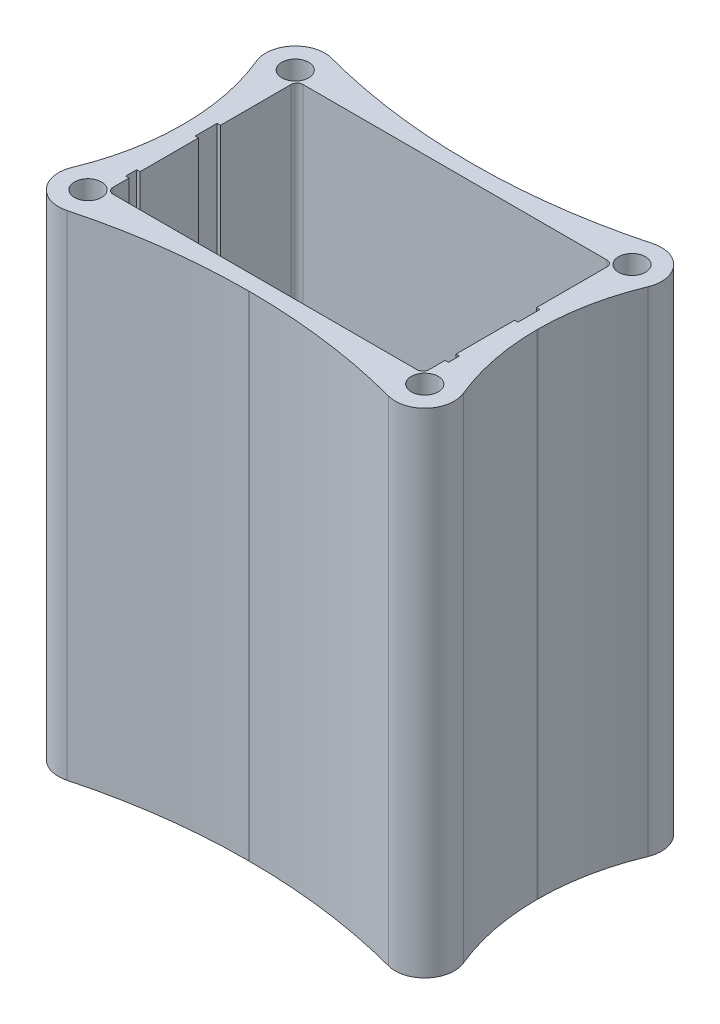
from build123d import *

# Parameters (mm, degrees)
SKETCH1_R           = 2.25
SKETCH1_W           = 13.58
SKETCH1_H           = 12.53
BOSS_EXTRUDE1_DEPTH = 7.25
SKETCH2_W           = 10
SKETCH2_H           = 12.53
CUT_EXTRUDE1_DEPTH  = 3.5
BOSS_EXTRUDE4_START = 75
SKETCH1_12_R        = 2.25
BOSS_EXTRUDE4_DEPTH = 75
FILLET1_R           = 40
FILLET2_R           = 103


with BuildPart() as part:
    # Sketch1 → Boss-Extrude1 (new body)
    with BuildSketch(Plane(origin=(0, 0, 0), x_dir=(1, 0, 0), z_dir=(0, 1, 0))):
        with BuildLine():
            Line((-29.56, 28.41642837), (-29.56, 3.25357163))
            ThreePointArc((-29.56, 3.25357163), (-31.446417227, -5.006638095), (-23.302108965, -2.67))
            Line((-23.302108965, -2.67), (23.302108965, -2.67))
            ThreePointArc((23.302108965, -2.67), (31.446417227, -5.006638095), (29.56, 3.25357163))
            Line((29.56, 3.25357163), (29.56, 28.41642837))
            ThreePointArc((29.56, 28.41642837), (31.446417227, 36.676638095), (23.302108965, 34.34))
            Line((23.302108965, 34.34), (-23.302108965, 34.34))
            ThreePointArc((-23.302108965, 34.34), (-31.446417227, 36.676638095), (-29.56, 28.41642837))
        make_face()
        with Locations(Location((-28.064205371, -1.433538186, 0), (0, 0, 270))):
            Circle(SKETCH1_R, mode=Mode.SUBTRACT)
        with Locations(Location((-28.064205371, 33.103538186, 0), (0, 0, 270))):
            Circle(SKETCH1_R, mode=Mode.SUBTRACT)
        with Locations(Location((28.064205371, 33.103538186, 0), (0, 0, 270))):
            Circle(SKETCH1_R, mode=Mode.SUBTRACT)
        with Locations(Location((28.064205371, -1.433538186, 0), (0, 0, 270))):
            Circle(SKETCH1_R, mode=Mode.SUBTRACT)
        with Locations((11.36, 10.85)):
            Rectangle(SKETCH1_W, SKETCH1_H, mode=Mode.SUBTRACT)
    extrude(amount=-BOSS_EXTRUDE1_DEPTH)

    # Sketch2 → Cut-Extrude1 (cut)
    with BuildSketch(Plane(origin=(0, 0, 0), x_dir=(1, 0, 0), z_dir=(0, 1, 0))):
        with Locations((-17.89, 10.85)):
            Rectangle(SKETCH2_W, SKETCH2_H)
    extrude(amount=-CUT_EXTRUDE1_DEPTH, mode=Mode.SUBTRACT)

    # Sketch1_12 → Boss-Extrude4 (add)
    with BuildSketch(Plane(origin=(0, 0, 0), x_dir=(1, 0, 0), z_dir=(0, 1, 0)).offset(BOSS_EXTRUDE4_START)):
        with BuildLine():
            Line((-29.56, 28.41642837), (-29.56, 3.25357163))
            ThreePointArc((-29.56, 3.25357163), (-31.446417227, -5.006638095), (-23.302108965, -2.67))
            Line((-23.302108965, -2.67), (23.302108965, -2.67))
            ThreePointArc((23.302108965, -2.67), (31.446417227, -5.006638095), (29.56, 3.25357163))
            Line((29.56, 3.25357163), (29.56, 28.41642837))
            ThreePointArc((29.56, 28.41642837), (31.446417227, 36.676638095), (23.302108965, 34.34))
            Line((23.302108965, 34.34), (-23.302108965, 34.34))
            ThreePointArc((-23.302108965, 34.34), (-31.446417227, 36.676638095), (-29.56, 28.41642837))
        make_face()
        with Locations(Location((-28.064205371, -1.433538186, 0), (0, 0, 270))):
            Circle(SKETCH1_12_R, mode=Mode.SUBTRACT)
        with Locations(Location((-28.064205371, 33.103538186, 0), (0, 0, 270))):
            Circle(SKETCH1_12_R, mode=Mode.SUBTRACT)
        with Locations(Location((28.064205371, 33.103538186, 0), (0, 0, 270))):
            Circle(SKETCH1_12_R, mode=Mode.SUBTRACT)
        with Locations(Location((28.064205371, -1.433538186, 0), (0, 0, 270))):
            Circle(SKETCH1_12_R, mode=Mode.SUBTRACT)
        with BuildLine():
            Line((-25.33, 0), (25.33, 0))
            ThreePointArc((25.33, 0), (26.037106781, 0.292893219), (26.33, 1))
            Line((26.33, 1), (26.33, 3.67))
            Line((26.33, 3.67), (26.89, 3.67))
            Line((26.89, 3.67), (26.89, 5.5))
            Line((26.89, 5.5), (26.33, 5.5))
            Line((26.33, 5.5), (26.33, 15.255))
            Line((26.33, 15.255), (26.89, 15.255))
            Line((26.89, 15.255), (26.89, 18.915))
            Line((26.89, 18.915), (26.33, 18.915))
            Line((26.33, 18.915), (26.33, 30.67))
            ThreePointArc((26.33, 30.67), (26.037106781, 31.377106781), (25.33, 31.67))
            Line((25.33, 31.67), (-25.33, 31.67))
            ThreePointArc((-25.33, 31.67), (-26.037106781, 31.377106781), (-26.33, 30.67))
            Line((-26.33, 30.67), (-26.33, 18.915))
            Line((-26.33, 18.915), (-26.89, 18.915))
            Line((-26.89, 18.915), (-26.89, 17.085))
            Line((-26.89, 17.085), (-26.89, 15.255))
            Line((-26.89, 15.255), (-26.33, 15.255))
            Line((-26.33, 15.255), (-26.33, 5.5))
            Line((-26.33, 5.5), (-26.89, 5.5))
            Line((-26.89, 5.5), (-26.89, 3.67))
            Line((-26.89, 3.67), (-26.33, 3.67))
            Line((-26.33, 3.67), (-26.33, 1))
            ThreePointArc((-26.33, 1), (-26.037106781, 0.292893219), (-25.33, 0))
        make_face(mode=Mode.SUBTRACT)
    extrude(amount=-BOSS_EXTRUDE4_DEPTH)

    # Fillet1
    fillet1_edges = [part.edges().sort_by_distance(p)[0] for p in [
        (-29.56, 33.875, -28.41642837),
        (-29.56, 33.875, -3.25357163),
        (29.56, 33.875, -3.25357163),
        (29.56, 33.875, -28.41642837),
    ]]
    fillet(fillet1_edges, radius=FILLET1_R)

    # Fillet2
    fillet2_edges = [part.edges().sort_by_distance(p)[0] for p in [
        (-23.302108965, 33.875, 2.67),
        (23.302108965, 33.875, 2.67),
        (23.302108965, 33.875, -34.34),
        (-23.302108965, 33.875, -34.34),
    ]]
    fillet(fillet2_edges, radius=FILLET2_R)


solid = part.part
